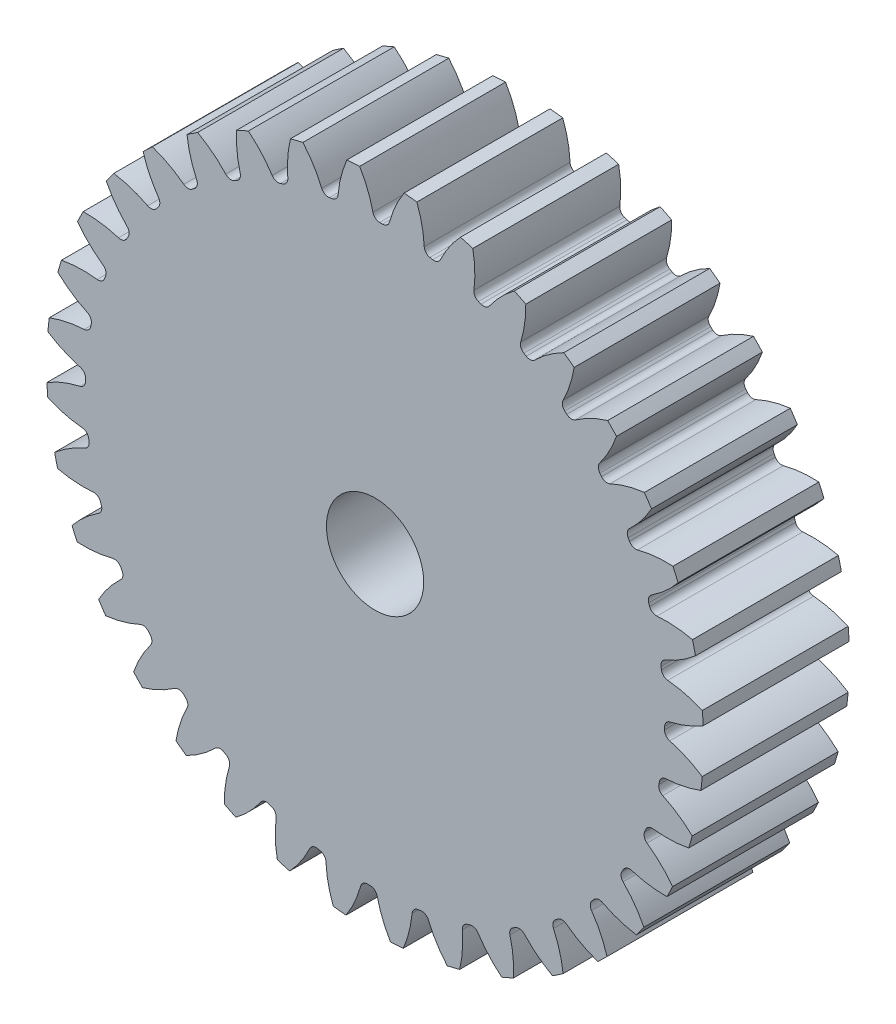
from build123d import *

# Parameters (mm, degrees)
SKETCH3_R         = 214.488888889
GEARBODY_DEPTH    = 95.25
TOOTHCUT_DEPTH    = 318.936360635
CIRPATTERN1_COUNT = 36
BOREDIA_R         = 31.75
BORE_DEPTH        = 12700


with BuildPart() as part:
    # Sketch3 → gearBody (new body)
    with BuildSketch(Plane.XY):
        Circle(SKETCH3_R)
    extrude(amount=GEARBODY_DEPTH)

    # Sketch2 → toothCut (cut, through all)
    with BuildSketch(Plane.XY):
        with BuildLine():
            ThreePointArc((189.026803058, -4.845165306), (189.047978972, -3.933134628), (189.064754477, -3.021012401))
            ThreePointArc((189.064754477, -3.021012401), (190.092023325, -0.198104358), (192.643982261, 1.386697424))
            ThreePointArc((192.643982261, 1.386697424), (203.92199777, 4.914624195), (214.488888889, 10.20430407))
            ThreePointArc((214.488888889, 10.20430407), (214.685028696, -4.466512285), (213.878871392, -19.116475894))
            ThreePointArc((213.878871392, -19.116475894), (203.541131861, -13.391876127), (192.419608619, -9.397927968))
            ThreePointArc((192.419608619, -9.397927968), (189.935772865, -7.708356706), (189.026803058, -4.845165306))
        make_face()
    toothcut = extrude(amount=TOOTHCUT_DEPTH, mode=Mode.SUBTRACT)

    # CirPattern1: toothCut ×36 about axis
    cirpattern1_axis = Axis((0, 0, 0), (0, 0, 1))
    for i in range(1, CIRPATTERN1_COUNT):
        add(toothcut.rotate(cirpattern1_axis, i * 360 / CIRPATTERN1_COUNT), mode=Mode.SUBTRACT)

    # boreDia → bore (cut, symmetric)
    with BuildSketch(Plane.XY):
        Circle(BOREDIA_R)
    extrude(amount=BORE_DEPTH, both=True, mode=Mode.SUBTRACT)


solid = part.part
